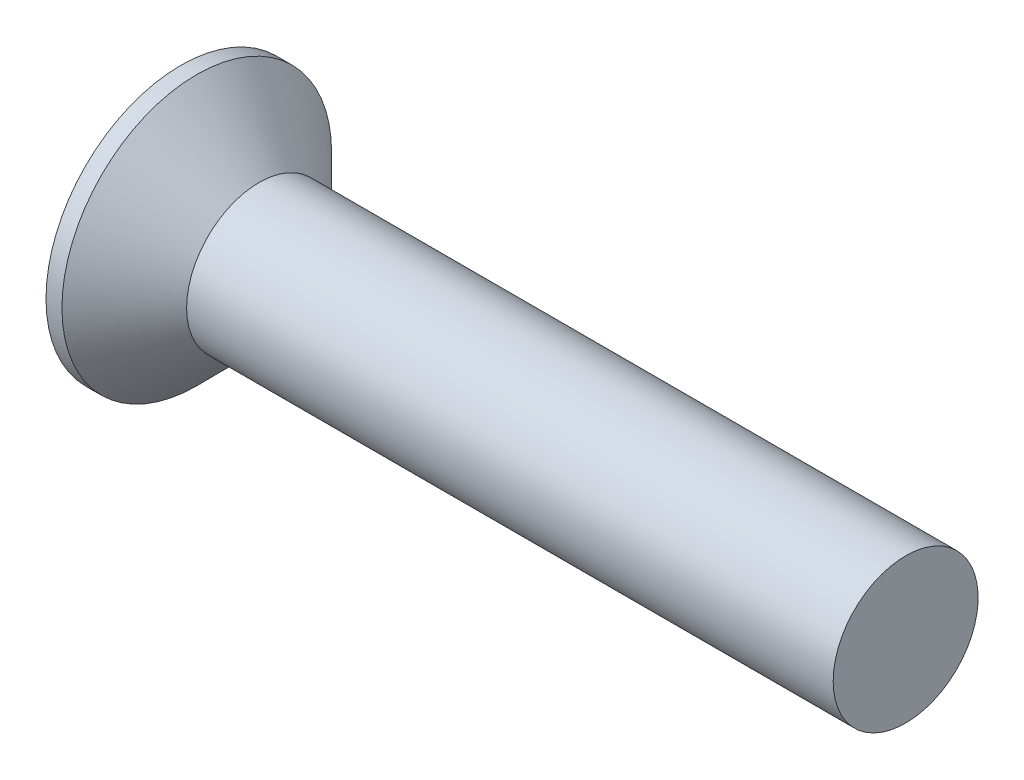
ISO-10303-21;
HEADER;
FILE_DESCRIPTION(('STEP AP214'),'2;1');
FILE_NAME('part.step','',(''),(''),'','','');
FILE_SCHEMA(('AUTOMOTIVE_DESIGN { 1 0 10303 214 1 1 1 1 }'));
ENDSEC;
DATA;
#1=APPLICATION_CONTEXT('core data for automotive mechanical design processes');
#2=APPLICATION_PROTOCOL_DEFINITION('international standard','automotive_design',2000,#1);
#3=PRODUCT_CONTEXT('',#1,'mechanical');
#4=PRODUCT('Part','Part','',(#3));
#5=PRODUCT_RELATED_PRODUCT_CATEGORY('part','',(#4));
#6=PRODUCT_DEFINITION_FORMATION('','',#4);
#7=PRODUCT_DEFINITION_CONTEXT('part definition',#1,'design');
#8=PRODUCT_DEFINITION('design','',#6,#7);
#9=PRODUCT_DEFINITION_SHAPE('','',#8);
#10=(LENGTH_UNIT() NAMED_UNIT(*) SI_UNIT(.MILLI.,.METRE.));
#11=(NAMED_UNIT(*) PLANE_ANGLE_UNIT() SI_UNIT($,.RADIAN.));
#12=(NAMED_UNIT(*) SI_UNIT($,.STERADIAN.) SOLID_ANGLE_UNIT());
#13=UNCERTAINTY_MEASURE_WITH_UNIT(LENGTH_MEASURE(1.E-05),#10,'distance_accuracy_value','');
#14=(GEOMETRIC_REPRESENTATION_CONTEXT(3) GLOBAL_UNCERTAINTY_ASSIGNED_CONTEXT((#13)) GLOBAL_UNIT_ASSIGNED_CONTEXT((#10,
#11,#12)) REPRESENTATION_CONTEXT('',''));
#15=CARTESIAN_POINT('',(0.,0.,0.));
#16=DIRECTION('',(0.,0.,1.));
#17=DIRECTION('',(1.,0.,0.));
#18=AXIS2_PLACEMENT_3D('',#15,#16,#17);
#19=CARTESIAN_POINT('',(0.,0.,0.));
#20=DIRECTION('',(-1.,0.,0.));
#21=DIRECTION('',(0.,0.,1.));
#22=AXIS2_PLACEMENT_3D('',#19,#20,#21);
#23=PLANE('',#22);
#24=CARTESIAN_POINT('',(0.,0.,0.));
#25=DIRECTION('',(-1.,0.,0.));
#26=DIRECTION('',(0.,0.,1.));
#27=AXIS2_PLACEMENT_3D('',#24,#25,#26);
#28=CIRCLE('',#27,4.65);
#29=CARTESIAN_POINT('',(0.,0.,4.65));
#30=VERTEX_POINT('',#29);
#31=EDGE_CURVE('E37',#30,#30,#28,.T.);
#32=ORIENTED_EDGE('',*,*,#31,.T.);
#33=EDGE_LOOP('',(#32));
#34=FACE_BOUND('',#33,.T.);
#35=DIRECTION('',(0.,1.,0.));
#36=VECTOR('',#35,1.);
#37=CARTESIAN_POINT('',(0.,-2.53,-0.52));
#38=LINE('',#37,#36);
#39=CARTESIAN_POINT('',(0.,-2.53,-0.52));
#40=VERTEX_POINT('',#39);
#41=CARTESIAN_POINT('',(0.,-0.519999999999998,-0.52));
#42=VERTEX_POINT('',#41);
#43=EDGE_CURVE('E98',#40,#42,#38,.T.);
#44=ORIENTED_EDGE('',*,*,#43,.T.);
#45=DIRECTION('',(0.,0.,-1.));
#46=VECTOR('',#45,1.);
#47=CARTESIAN_POINT('',(0.,-0.520000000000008,2.53));
#48=LINE('',#47,#46);
#49=CARTESIAN_POINT('',(0.,-0.519999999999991,-2.53));
#50=VERTEX_POINT('',#49);
#51=EDGE_CURVE('E78',#42,#50,#48,.T.);
#52=ORIENTED_EDGE('',*,*,#51,.T.);
#53=DIRECTION('',(0.,1.,0.));
#54=VECTOR('',#53,1.);
#55=CARTESIAN_POINT('',(0.,-0.519999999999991,-2.53));
#56=LINE('',#55,#54);
#57=CARTESIAN_POINT('',(0.,0.520000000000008,-2.53));
#58=VERTEX_POINT('',#57);
#59=EDGE_CURVE('E333',#50,#58,#56,.T.);
#60=ORIENTED_EDGE('',*,*,#59,.T.);
#61=DIRECTION('',(0.,0.,1.));
#62=VECTOR('',#61,1.);
#63=CARTESIAN_POINT('',(0.,0.520000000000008,-2.53));
#64=LINE('',#63,#62);
#65=CARTESIAN_POINT('',(0.,0.520000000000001,-0.52));
#66=VERTEX_POINT('',#65);
#67=EDGE_CURVE('E94',#58,#66,#64,.T.);
#68=ORIENTED_EDGE('',*,*,#67,.T.);
#69=CARTESIAN_POINT('',(0.,2.53,-0.52));
#70=VERTEX_POINT('',#69);
#71=EDGE_CURVE('E88',#66,#70,#38,.T.);
#72=ORIENTED_EDGE('',*,*,#71,.T.);
#73=DIRECTION('',(0.,0.,1.));
#74=VECTOR('',#73,1.);
#75=CARTESIAN_POINT('',(0.,2.53,-0.52));
#76=LINE('',#75,#74);
#77=CARTESIAN_POINT('',(0.,2.53,0.52));
#78=VERTEX_POINT('',#77);
#79=EDGE_CURVE('E91',#70,#78,#76,.T.);
#80=ORIENTED_EDGE('',*,*,#79,.T.);
#81=DIRECTION('',(0.,-1.,0.));
#82=VECTOR('',#81,1.);
#83=CARTESIAN_POINT('',(0.,2.53,0.52));
#84=LINE('',#83,#82);
#85=CARTESIAN_POINT('',(0.,0.519999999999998,0.52));
#86=VERTEX_POINT('',#85);
#87=EDGE_CURVE('E345',#78,#86,#84,.T.);
#88=ORIENTED_EDGE('',*,*,#87,.T.);
#89=CARTESIAN_POINT('',(0.,0.519999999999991,2.53));
#90=VERTEX_POINT('',#89);
#91=EDGE_CURVE('E328',#86,#90,#64,.T.);
#92=ORIENTED_EDGE('',*,*,#91,.T.);
#93=DIRECTION('',(0.,-1.,0.));
#94=VECTOR('',#93,1.);
#95=CARTESIAN_POINT('',(0.,0.519999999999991,2.53));
#96=LINE('',#95,#94);
#97=CARTESIAN_POINT('',(0.,-0.520000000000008,2.53));
#98=VERTEX_POINT('',#97);
#99=EDGE_CURVE('E314',#90,#98,#96,.T.);
#100=ORIENTED_EDGE('',*,*,#99,.T.);
#101=CARTESIAN_POINT('',(0.,-0.520000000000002,0.52));
#102=VERTEX_POINT('',#101);
#103=EDGE_CURVE('E326',#98,#102,#48,.T.);
#104=ORIENTED_EDGE('',*,*,#103,.T.);
#105=CARTESIAN_POINT('',(0.,-2.53,0.52));
#106=VERTEX_POINT('',#105);
#107=EDGE_CURVE('E104',#102,#106,#84,.T.);
#108=ORIENTED_EDGE('',*,*,#107,.T.);
#109=DIRECTION('',(0.,0.,-1.));
#110=VECTOR('',#109,1.);
#111=CARTESIAN_POINT('',(0.,-2.53,0.52));
#112=LINE('',#111,#110);
#113=EDGE_CURVE('E127',#106,#40,#112,.T.);
#114=ORIENTED_EDGE('',*,*,#113,.T.);
#115=EDGE_LOOP('',(#44,#52,#60,#68,#72,#80,#88,#92,#100,#104,#108,#114));
#116=FACE_BOUND('',#115,.T.);
#117=ADVANCED_FACE('F30',(#34,#116),#23,.T.);
#118=CARTESIAN_POINT('',(3.73370044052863,0.,0.230220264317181));
#119=DIRECTION('',(-0.077379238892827,0.,-0.997001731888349));
#120=DIRECTION('',(-0.997001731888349,0.,0.077379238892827));
#121=AXIS2_PLACEMENT_3D('',#118,#119,#120);
#122=PLANE('',#121);
#123=ORIENTED_EDGE('',*,*,#107,.F.);
#124=DIRECTION('',(0.994030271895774,0.0771486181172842,-0.0771486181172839));
#125=VECTOR('',#124,1.);
#126=CARTESIAN_POINT('',(3.75135558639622,-0.228850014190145,0.228850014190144));
#127=LINE('',#126,#125);
#128=CARTESIAN_POINT('',(3.35,-0.260000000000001,0.259999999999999));
#129=VERTEX_POINT('',#128);
#130=EDGE_CURVE('E122',#102,#129,#127,.T.);
#131=ORIENTED_EDGE('',*,*,#130,.T.);
#132=DIRECTION('',(0.826141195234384,0.5598031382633,-0.0641184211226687));
#133=VECTOR('',#132,1.);
#134=CARTESIAN_POINT('',(0.,-2.53,0.52));
#135=LINE('',#134,#133);
#136=EDGE_CURVE('E99',#106,#129,#135,.T.);
#137=ORIENTED_EDGE('',*,*,#136,.F.);
#138=EDGE_LOOP('',(#123,#131,#137));
#139=FACE_BOUND('',#138,.T.);
#140=ADVANCED_FACE('F150',(#139),#122,.T.);
#141=DIRECTION('',(0.826141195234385,-0.559803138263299,-0.0641184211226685));
#142=VECTOR('',#141,1.);
#143=CARTESIAN_POINT('',(0.,2.53,0.52));
#144=LINE('',#143,#142);
#145=CARTESIAN_POINT('',(3.35,0.26,0.26));
#146=VERTEX_POINT('',#145);
#147=EDGE_CURVE('E44',#78,#146,#144,.T.);
#148=ORIENTED_EDGE('',*,*,#147,.T.);
#149=DIRECTION('',(-0.994030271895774,0.0771486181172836,0.0771486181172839));
#150=VECTOR('',#149,1.);
#151=CARTESIAN_POINT('',(3.75135558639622,0.228850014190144,0.228850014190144));
#152=LINE('',#151,#150);
#153=EDGE_CURVE('E341',#146,#86,#152,.T.);
#154=ORIENTED_EDGE('',*,*,#153,.T.);
#155=ORIENTED_EDGE('',*,*,#87,.F.);
#156=EDGE_LOOP('',(#148,#154,#155));
#157=FACE_BOUND('',#156,.T.);
#158=ADVANCED_FACE('F154',(#157),#122,.T.);
#159=CARTESIAN_POINT('',(3.73370044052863,0.,-0.230220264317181));
#160=DIRECTION('',(-0.077379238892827,0.,0.997001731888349));
#161=DIRECTION('',(0.997001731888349,0.,0.077379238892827));
#162=AXIS2_PLACEMENT_3D('',#159,#160,#161);
#163=PLANE('',#162);
#164=DIRECTION('',(0.826141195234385,0.559803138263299,0.0641184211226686));
#165=VECTOR('',#164,1.);
#166=CARTESIAN_POINT('',(0.,-2.53,-0.52));
#167=LINE('',#166,#165);
#168=CARTESIAN_POINT('',(3.35,-0.259999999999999,-0.260000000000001));
#169=VERTEX_POINT('',#168);
#170=EDGE_CURVE('E53',#40,#169,#167,.T.);
#171=ORIENTED_EDGE('',*,*,#170,.T.);
#172=DIRECTION('',(-0.994030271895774,-0.0771486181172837,-0.0771486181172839));
#173=VECTOR('',#172,1.);
#174=CARTESIAN_POINT('',(3.75135558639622,-0.228850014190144,-0.228850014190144));
#175=LINE('',#174,#173);
#176=EDGE_CURVE('E11',#169,#42,#175,.T.);
#177=ORIENTED_EDGE('',*,*,#176,.T.);
#178=ORIENTED_EDGE('',*,*,#43,.F.);
#179=EDGE_LOOP('',(#171,#177,#178));
#180=FACE_BOUND('',#179,.T.);
#181=ADVANCED_FACE('F147',(#180),#163,.T.);
#182=ORIENTED_EDGE('',*,*,#71,.F.);
#183=DIRECTION('',(0.994030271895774,-0.0771486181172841,0.0771486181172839));
#184=VECTOR('',#183,1.);
#185=CARTESIAN_POINT('',(3.75135558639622,0.228850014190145,-0.228850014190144));
#186=LINE('',#185,#184);
#187=CARTESIAN_POINT('',(3.35,0.26,-0.26));
#188=VERTEX_POINT('',#187);
#189=EDGE_CURVE('E107',#66,#188,#186,.T.);
#190=ORIENTED_EDGE('',*,*,#189,.T.);
#191=DIRECTION('',(0.826141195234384,-0.559803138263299,0.0641184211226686));
#192=VECTOR('',#191,1.);
#193=CARTESIAN_POINT('',(0.,2.53,-0.52));
#194=LINE('',#193,#192);
#195=EDGE_CURVE('E103',#70,#188,#194,.T.);
#196=ORIENTED_EDGE('',*,*,#195,.F.);
#197=EDGE_LOOP('',(#182,#190,#196));
#198=FACE_BOUND('',#197,.T.);
#199=ADVANCED_FACE('F106',(#198),#163,.T.);
#200=CARTESIAN_POINT('',(-6.34999999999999,0.,0.));
#201=DIRECTION('',(-1.,0.,0.));
#202=DIRECTION('',(0.,0.,1.));
#203=AXIS2_PLACEMENT_3D('',#200,#201,#202);
#204=CYLINDRICAL_SURFACE('',#203,4.65);
#205=CARTESIAN_POINT('',(0.550000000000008,0.,0.));
#206=DIRECTION('',(-1.,0.,0.));
#207=DIRECTION('',(0.,0.,1.));
#208=AXIS2_PLACEMENT_3D('',#205,#206,#207);
#209=CIRCLE('',#208,4.65);
#210=CARTESIAN_POINT('',(0.550000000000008,0.,4.65));
#211=VERTEX_POINT('',#210);
#212=EDGE_CURVE('E130',#211,#211,#209,.T.);
#213=ORIENTED_EDGE('',*,*,#212,.T.);
#214=EDGE_LOOP('',(#213));
#215=FACE_BOUND('',#214,.T.);
#216=ORIENTED_EDGE('',*,*,#31,.F.);
#217=EDGE_LOOP('',(#216));
#218=FACE_BOUND('',#217,.T.);
#219=ADVANCED_FACE('F136',(#215,#218),#204,.T.);
#220=CARTESIAN_POINT('',(0.550000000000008,0.,0.));
#221=DIRECTION('',(-1.,0.,0.));
#222=DIRECTION('',(0.,0.,1.));
#223=AXIS2_PLACEMENT_3D('',#220,#221,#222);
#224=CONICAL_SURFACE('',#223,4.65,0.78539816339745);
#225=CARTESIAN_POINT('',(2.7,0.,0.));
#226=DIRECTION('',(-1.,0.,0.));
#227=DIRECTION('',(0.,0.,1.));
#228=AXIS2_PLACEMENT_3D('',#225,#226,#227);
#229=CIRCLE('',#228,2.5);
#230=CARTESIAN_POINT('',(2.7,0.,2.5));
#231=VERTEX_POINT('',#230);
#232=EDGE_CURVE('E126',#231,#231,#229,.T.);
#233=ORIENTED_EDGE('',*,*,#232,.T.);
#234=EDGE_LOOP('',(#233));
#235=FACE_BOUND('',#234,.T.);
#236=ORIENTED_EDGE('',*,*,#212,.F.);
#237=EDGE_LOOP('',(#236));
#238=FACE_BOUND('',#237,.T.);
#239=ADVANCED_FACE('F138',(#235,#238),#224,.T.);
#240=CARTESIAN_POINT('',(-6.34999999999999,0.,0.));
#241=DIRECTION('',(-1.,0.,0.));
#242=DIRECTION('',(0.,0.,1.));
#243=AXIS2_PLACEMENT_3D('',#240,#241,#242);
#244=CYLINDRICAL_SURFACE('',#243,2.5);
#245=CARTESIAN_POINT('',(25.,0.,0.));
#246=DIRECTION('',(-1.,0.,0.));
#247=DIRECTION('',(0.,0.,1.));
#248=AXIS2_PLACEMENT_3D('',#245,#246,#247);
#249=CIRCLE('',#248,2.5);
#250=CARTESIAN_POINT('',(25.,0.,2.5));
#251=VERTEX_POINT('',#250);
#252=EDGE_CURVE('E123',#251,#251,#249,.T.);
#253=ORIENTED_EDGE('',*,*,#252,.T.);
#254=EDGE_LOOP('',(#253));
#255=FACE_BOUND('',#254,.T.);
#256=ORIENTED_EDGE('',*,*,#232,.F.);
#257=EDGE_LOOP('',(#256));
#258=FACE_BOUND('',#257,.T.);
#259=ADVANCED_FACE('F144',(#255,#258),#244,.T.);
#260=CARTESIAN_POINT('',(25.,2.5,0.));
#261=DIRECTION('',(1.,0.,0.));
#262=DIRECTION('',(0.,0.,-1.));
#263=AXIS2_PLACEMENT_3D('',#260,#261,#262);
#264=PLANE('',#263);
#265=ORIENTED_EDGE('',*,*,#252,.F.);
#266=EDGE_LOOP('',(#265));
#267=FACE_BOUND('',#266,.T.);
#268=ADVANCED_FACE('F174',(#267),#264,.T.);
#269=CARTESIAN_POINT('',(3.35,0.26,-0.26));
#270=DIRECTION('',(1.,0.,0.));
#271=DIRECTION('',(0.,0.,-1.));
#272=AXIS2_PLACEMENT_3D('',#269,#270,#271);
#273=PLANE('',#272);
#274=DIRECTION('',(0.,1.,0.));
#275=VECTOR('',#274,1.);
#276=CARTESIAN_POINT('',(3.35,-0.26,-0.26));
#277=LINE('',#276,#275);
#278=EDGE_CURVE('E118',#169,#188,#277,.T.);
#279=ORIENTED_EDGE('',*,*,#278,.F.);
#280=DIRECTION('',(0.,0.,-1.));
#281=VECTOR('',#280,1.);
#282=CARTESIAN_POINT('',(3.35,-0.26,0.26));
#283=LINE('',#282,#281);
#284=EDGE_CURVE('E109',#129,#169,#283,.T.);
#285=ORIENTED_EDGE('',*,*,#284,.F.);
#286=DIRECTION('',(0.,-1.,0.));
#287=VECTOR('',#286,1.);
#288=CARTESIAN_POINT('',(3.35,0.26,0.26));
#289=LINE('',#288,#287);
#290=EDGE_CURVE('E112',#146,#129,#289,.T.);
#291=ORIENTED_EDGE('',*,*,#290,.F.);
#292=DIRECTION('',(0.,0.,1.));
#293=VECTOR('',#292,1.);
#294=CARTESIAN_POINT('',(3.35,0.26,-0.26));
#295=LINE('',#294,#293);
#296=EDGE_CURVE('E116',#188,#146,#295,.T.);
#297=ORIENTED_EDGE('',*,*,#296,.F.);
#298=EDGE_LOOP('',(#279,#285,#291,#297));
#299=FACE_BOUND('',#298,.T.);
#300=ADVANCED_FACE('F171',(#299),#273,.F.);
#301=CARTESIAN_POINT('',(0.,-2.53,-0.52));
#302=DIRECTION('',(-0.560957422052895,0.827844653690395,0.));
#303=DIRECTION('',(-0.827844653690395,-0.560957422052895,0.));
#304=AXIS2_PLACEMENT_3D('',#301,#302,#303);
#305=PLANE('',#304);
#306=ORIENTED_EDGE('',*,*,#170,.F.);
#307=ORIENTED_EDGE('',*,*,#113,.F.);
#308=ORIENTED_EDGE('',*,*,#136,.T.);
#309=ORIENTED_EDGE('',*,*,#284,.T.);
#310=EDGE_LOOP('',(#306,#307,#308,#309));
#311=FACE_BOUND('',#310,.T.);
#312=ADVANCED_FACE('F163',(#311),#305,.T.);
#313=CARTESIAN_POINT('',(0.,2.53,0.52));
#314=DIRECTION('',(-0.560957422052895,-0.827844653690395,0.));
#315=DIRECTION('',(0.827844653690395,-0.560957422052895,0.));
#316=AXIS2_PLACEMENT_3D('',#313,#314,#315);
#317=PLANE('',#316);
#318=ORIENTED_EDGE('',*,*,#147,.F.);
#319=ORIENTED_EDGE('',*,*,#79,.F.);
#320=ORIENTED_EDGE('',*,*,#195,.T.);
#321=ORIENTED_EDGE('',*,*,#296,.T.);
#322=EDGE_LOOP('',(#318,#319,#320,#321));
#323=FACE_BOUND('',#322,.T.);
#324=ADVANCED_FACE('F102',(#323),#317,.T.);
#325=CARTESIAN_POINT('',(3.73370044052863,-0.230220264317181,0.));
#326=DIRECTION('',(-0.077379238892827,0.997001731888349,0.));
#327=DIRECTION('',(-0.997001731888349,-0.077379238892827,0.));
#328=AXIS2_PLACEMENT_3D('',#325,#326,#327);
#329=PLANE('',#328);
#330=DIRECTION('',(0.826141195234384,0.0641184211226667,0.5598031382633));
#331=VECTOR('',#330,1.);
#332=CARTESIAN_POINT('',(0.,-0.519999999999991,-2.53));
#333=LINE('',#332,#331);
#334=EDGE_CURVE('E335',#50,#169,#333,.T.);
#335=ORIENTED_EDGE('',*,*,#334,.F.);
#336=ORIENTED_EDGE('',*,*,#51,.F.);
#337=ORIENTED_EDGE('',*,*,#176,.F.);
#338=EDGE_LOOP('',(#335,#336,#337));
#339=FACE_BOUND('',#338,.T.);
#340=ADVANCED_FACE('F170',(#339),#329,.T.);
#341=CARTESIAN_POINT('',(3.73370044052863,0.230220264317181,0.));
#342=DIRECTION('',(-0.077379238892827,-0.997001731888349,0.));
#343=DIRECTION('',(0.997001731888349,-0.077379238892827,0.));
#344=AXIS2_PLACEMENT_3D('',#341,#342,#343);
#345=PLANE('',#344);
#346=ORIENTED_EDGE('',*,*,#67,.F.);
#347=DIRECTION('',(0.826141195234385,-0.0641184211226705,0.559803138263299));
#348=VECTOR('',#347,1.);
#349=CARTESIAN_POINT('',(0.,0.520000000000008,-2.53));
#350=LINE('',#349,#348);
#351=EDGE_CURVE('E69',#58,#188,#350,.T.);
#352=ORIENTED_EDGE('',*,*,#351,.T.);
#353=ORIENTED_EDGE('',*,*,#189,.F.);
#354=EDGE_LOOP('',(#346,#352,#353));
#355=FACE_BOUND('',#354,.T.);
#356=ADVANCED_FACE('F214',(#355),#345,.T.);
#357=CARTESIAN_POINT('',(0.,0.520000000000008,-2.53));
#358=DIRECTION('',(-0.560957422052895,0.,0.827844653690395));
#359=DIRECTION('',(-0.827844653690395,0.,-0.560957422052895));
#360=AXIS2_PLACEMENT_3D('',#357,#358,#359);
#361=PLANE('',#360);
#362=ORIENTED_EDGE('',*,*,#351,.F.);
#363=ORIENTED_EDGE('',*,*,#59,.F.);
#364=ORIENTED_EDGE('',*,*,#334,.T.);
#365=ORIENTED_EDGE('',*,*,#278,.T.);
#366=EDGE_LOOP('',(#362,#363,#364,#365));
#367=FACE_BOUND('',#366,.T.);
#368=ADVANCED_FACE('F222',(#367),#361,.T.);
#369=ORIENTED_EDGE('',*,*,#103,.F.);
#370=DIRECTION('',(0.826141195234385,0.0641184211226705,-0.559803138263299));
#371=VECTOR('',#370,1.);
#372=CARTESIAN_POINT('',(0.,-0.520000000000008,2.53));
#373=LINE('',#372,#371);
#374=EDGE_CURVE('E311',#98,#129,#373,.T.);
#375=ORIENTED_EDGE('',*,*,#374,.T.);
#376=ORIENTED_EDGE('',*,*,#130,.F.);
#377=EDGE_LOOP('',(#369,#375,#376));
#378=FACE_BOUND('',#377,.T.);
#379=ADVANCED_FACE('F216',(#378),#329,.T.);
#380=DIRECTION('',(0.826141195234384,-0.0641184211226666,-0.5598031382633));
#381=VECTOR('',#380,1.);
#382=CARTESIAN_POINT('',(0.,0.519999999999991,2.53));
#383=LINE('',#382,#381);
#384=EDGE_CURVE('E322',#90,#146,#383,.T.);
#385=ORIENTED_EDGE('',*,*,#384,.F.);
#386=ORIENTED_EDGE('',*,*,#91,.F.);
#387=ORIENTED_EDGE('',*,*,#153,.F.);
#388=EDGE_LOOP('',(#385,#386,#387));
#389=FACE_BOUND('',#388,.T.);
#390=ADVANCED_FACE('F224',(#389),#345,.T.);
#391=CARTESIAN_POINT('',(0.,-0.520000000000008,2.53));
#392=DIRECTION('',(-0.560957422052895,0.,-0.827844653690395));
#393=DIRECTION('',(0.827844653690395,0.,-0.560957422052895));
#394=AXIS2_PLACEMENT_3D('',#391,#392,#393);
#395=PLANE('',#394);
#396=ORIENTED_EDGE('',*,*,#374,.F.);
#397=ORIENTED_EDGE('',*,*,#99,.F.);
#398=ORIENTED_EDGE('',*,*,#384,.T.);
#399=ORIENTED_EDGE('',*,*,#290,.T.);
#400=EDGE_LOOP('',(#396,#397,#398,#399));
#401=FACE_BOUND('',#400,.T.);
#402=ADVANCED_FACE('F243',(#401),#395,.T.);
#403=CLOSED_SHELL('',(#117,#140,#158,#181,#199,#219,#239,#259,#268,#300,#312,#324,#340,#356,
#368,#379,#390,#402));
#404=MANIFOLD_SOLID_BREP('B2',#403);
#405=ADVANCED_BREP_SHAPE_REPRESENTATION('',(#18,#404),#14);
#406=SHAPE_DEFINITION_REPRESENTATION(#9,#405);
ENDSEC;
END-ISO-10303-21;
